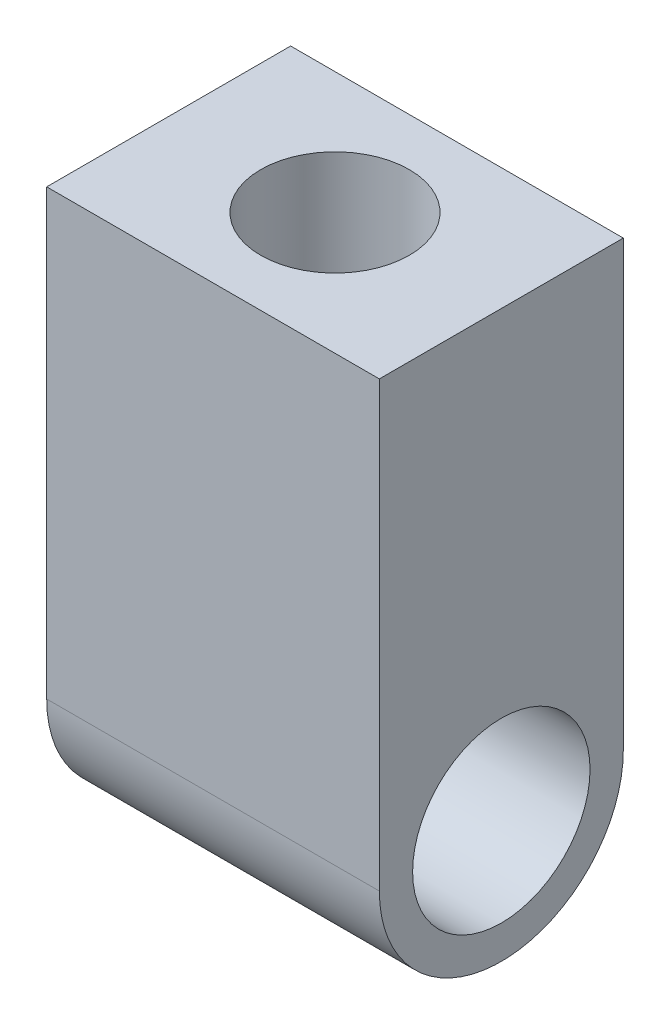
from build123d import *

# Parameters (mm, degrees)
SKETCH1_R           = 4
BOSS_EXTRUDE1_DEPTH = 7.5
SKETCH2_R           = 3.35
CUT_EXTRUDE1_DEPTH  = 14


with BuildPart() as part:
    # Sketch1 → Boss-Extrude1 (new, symmetric)
    with BuildSketch(Plane(origin=(0, 0, 0), x_dir=(0, 0, -1), z_dir=(1, 0, 0))):
        with BuildLine():
            Line((-5.5, 0), (-5.5, 20))
            Line((-5.5, 20), (5.5, 20))
            Line((5.5, 20), (5.5, 0))
            ThreePointArc((5.5, 0), (0, -5.5), (-5.5, 0))
        make_face()
        Circle(SKETCH1_R, mode=Mode.SUBTRACT)
    extrude(amount=BOSS_EXTRUDE1_DEPTH, both=True)

    # Sketch2 → Cut-Extrude1 (cut)
    with BuildSketch(Plane(origin=(0, 20, 0), x_dir=(1, 0, 0), z_dir=(0, 1, 0))):
        with Locations(Location((0, 0, 0), (0, 0, 270))):
            Circle(SKETCH2_R)
    extrude(amount=-CUT_EXTRUDE1_DEPTH, mode=Mode.SUBTRACT)


solid = part.part
